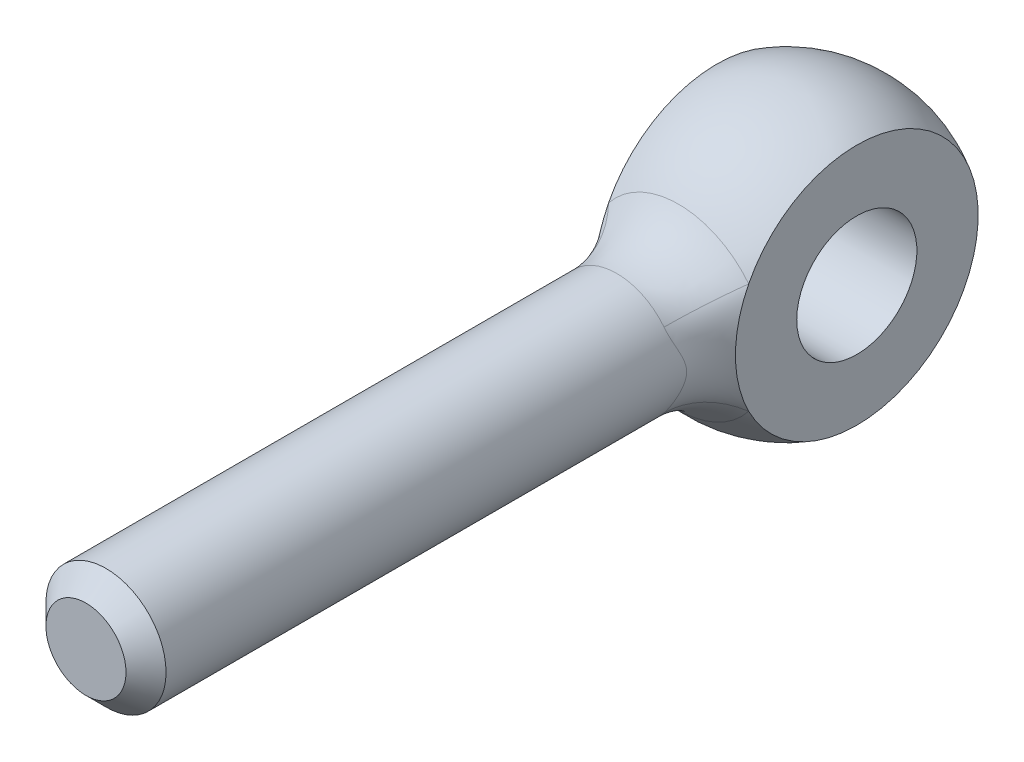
ISO-10303-21;
HEADER;
FILE_DESCRIPTION(('STEP AP214'),'2;1');
FILE_NAME('part.step','',(''),(''),'','','');
FILE_SCHEMA(('AUTOMOTIVE_DESIGN { 1 0 10303 214 1 1 1 1 }'));
ENDSEC;
DATA;
#1=APPLICATION_CONTEXT('core data for automotive mechanical design processes');
#2=APPLICATION_PROTOCOL_DEFINITION('international standard','automotive_design',2000,#1);
#3=PRODUCT_CONTEXT('',#1,'mechanical');
#4=PRODUCT('Part','Part','',(#3));
#5=PRODUCT_RELATED_PRODUCT_CATEGORY('part','',(#4));
#6=PRODUCT_DEFINITION_FORMATION('','',#4);
#7=PRODUCT_DEFINITION_CONTEXT('part definition',#1,'design');
#8=PRODUCT_DEFINITION('design','',#6,#7);
#9=PRODUCT_DEFINITION_SHAPE('','',#8);
#10=(LENGTH_UNIT() NAMED_UNIT(*) SI_UNIT(.MILLI.,.METRE.));
#11=(NAMED_UNIT(*) PLANE_ANGLE_UNIT() SI_UNIT($,.RADIAN.));
#12=(NAMED_UNIT(*) SI_UNIT($,.STERADIAN.) SOLID_ANGLE_UNIT());
#13=UNCERTAINTY_MEASURE_WITH_UNIT(LENGTH_MEASURE(1.E-05),#10,'distance_accuracy_value','');
#14=(GEOMETRIC_REPRESENTATION_CONTEXT(3) GLOBAL_UNCERTAINTY_ASSIGNED_CONTEXT((#13)) GLOBAL_UNIT_ASSIGNED_CONTEXT((#10,
#11,#12)) REPRESENTATION_CONTEXT('',''));
#15=CARTESIAN_POINT('',(0.,0.,0.));
#16=DIRECTION('',(0.,0.,1.));
#17=DIRECTION('',(1.,0.,0.));
#18=AXIS2_PLACEMENT_3D('',#15,#16,#17);
#19=CARTESIAN_POINT('',(0.,0.,0.));
#20=DIRECTION('',(-1.,0.,0.));
#21=DIRECTION('',(0.,0.,-1.));
#22=AXIS2_PLACEMENT_3D('',#19,#20,#21);
#23=SPHERICAL_SURFACE('',#22,7.);
#24=CARTESIAN_POINT('',(3.5,0.,0.));
#25=DIRECTION('',(1.,0.,0.));
#26=DIRECTION('',(0.,0.,1.));
#27=AXIS2_PLACEMENT_3D('',#24,#25,#26);
#28=CIRCLE('',#27,6.06217782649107);
#29=CARTESIAN_POINT('',(3.5,2.75553537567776,5.39972451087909));
#30=VERTEX_POINT('',#29);
#31=CARTESIAN_POINT('',(3.5,-2.75553537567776,5.39972451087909));
#32=VERTEX_POINT('',#31);
#33=EDGE_CURVE('E64',#30,#32,#28,.F.);
#34=ORIENTED_EDGE('',*,*,#33,.T.);
#35=CARTESIAN_POINT('',(0.,0.,5.39972451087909));
#36=DIRECTION('',(0.,0.,-1.));
#37=DIRECTION('',(-1.,0.,0.));
#38=AXIS2_PLACEMENT_3D('',#35,#36,#37);
#39=CIRCLE('',#38,4.45454545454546);
#40=CARTESIAN_POINT('',(-3.5,-2.75553537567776,5.39972451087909));
#41=VERTEX_POINT('',#40);
#42=EDGE_CURVE('E72',#32,#41,#39,.T.);
#43=ORIENTED_EDGE('',*,*,#42,.T.);
#44=CARTESIAN_POINT('',(-3.5,0.,0.));
#45=DIRECTION('',(1.,0.,0.));
#46=DIRECTION('',(0.,0.,1.));
#47=AXIS2_PLACEMENT_3D('',#44,#45,#46);
#48=CIRCLE('',#47,6.06217782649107);
#49=CARTESIAN_POINT('',(-3.5,2.75553537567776,5.39972451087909));
#50=VERTEX_POINT('',#49);
#51=EDGE_CURVE('E60',#50,#41,#48,.F.);
#52=ORIENTED_EDGE('',*,*,#51,.F.);
#53=CARTESIAN_POINT('',(0.,0.,5.39972451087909));
#54=DIRECTION('',(0.,0.,-1.));
#55=DIRECTION('',(-1.,0.,0.));
#56=AXIS2_PLACEMENT_3D('',#53,#54,#55);
#57=CIRCLE('',#56,4.45454545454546);
#58=EDGE_CURVE('E69',#50,#30,#57,.T.);
#59=ORIENTED_EDGE('',*,*,#58,.T.);
#60=EDGE_LOOP('',(#34,#43,#52,#59));
#61=FACE_BOUND('',#60,.T.);
#62=ADVANCED_FACE('F14',(#61),#23,.T.);
#63=CARTESIAN_POINT('',(0.,0.,-10.));
#64=DIRECTION('',(0.,0.,-1.));
#65=DIRECTION('',(1.,0.,0.));
#66=AXIS2_PLACEMENT_3D('',#63,#64,#65);
#67=CYLINDRICAL_SURFACE('',#66,3.);
#68=CARTESIAN_POINT('',(3.5,3.23557827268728,5.12650302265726));
#69=CARTESIAN_POINT('',(2.21863332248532,2.04715505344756,6.30296016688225));
#70=CARTESIAN_POINT('',(1.96436370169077,2.26743803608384,8.38265343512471));
#71=CARTESIAN_POINT('',(3.5,3.1991343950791,5.14950105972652));
#72=CARTESIAN_POINT('',(2.22557997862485,2.03413368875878,6.33043159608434));
#73=CARTESIAN_POINT('',(2.00002659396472,2.23654422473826,8.40046287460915));
#74=CARTESIAN_POINT('',(3.5,3.16190695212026,5.17245733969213));
#75=CARTESIAN_POINT('',(2.23371606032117,2.02068665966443,6.35734290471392));
#76=CARTESIAN_POINT('',(2.03507440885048,2.20470514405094,8.4158033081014));
#77=CARTESIAN_POINT('',(3.5,3.08569578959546,5.21828180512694));
#78=CARTESIAN_POINT('',(2.25234735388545,1.99246404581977,6.40983640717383));
#79=CARTESIAN_POINT('',(2.10377448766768,2.13924810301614,8.44176635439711));
#80=CARTESIAN_POINT('',(3.5,3.04671284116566,5.2411500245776));
#81=CARTESIAN_POINT('',(2.2628303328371,1.97769838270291,6.43541471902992));
#82=CARTESIAN_POINT('',(2.13742735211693,2.10563092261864,8.45239101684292));
#83=CARTESIAN_POINT('',(3.5,2.92713810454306,5.30945187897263));
#84=CARTESIAN_POINT('',(2.29762891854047,1.9308753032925,6.50965537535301));
#85=CARTESIAN_POINT('',(2.23581231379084,2.00253050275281,8.47747005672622));
#86=CARTESIAN_POINT('',(3.5,2.8436146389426,5.35477773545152));
#87=CARTESIAN_POINT('',(2.32540834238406,1.89608630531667,6.55631945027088));
#88=CARTESIAN_POINT('',(2.29827584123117,1.930534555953,8.48527657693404));
#89=CARTESIAN_POINT('',(3.5,2.68828049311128,5.43404462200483));
#90=CARTESIAN_POINT('',(2.38119716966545,1.82520856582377,6.63251730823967));
#91=CARTESIAN_POINT('',(2.40209207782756,1.79867960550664,8.48528503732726));
#92=CARTESIAN_POINT('',(3.5,2.61836938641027,5.46814371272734));
#93=CARTESIAN_POINT('',(2.40751211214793,1.79148689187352,6.66344728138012));
#94=CARTESIAN_POINT('',(2.44494437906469,1.73997552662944,8.48073996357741));
#95=CARTESIAN_POINT('',(3.5,2.47253010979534,5.53561665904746));
#96=CARTESIAN_POINT('',(2.46336082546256,1.71657198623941,6.72077052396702));
#97=CARTESIAN_POINT('',(2.52619122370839,1.61975821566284,8.46374010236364));
#98=CARTESIAN_POINT('',(3.5,2.39660211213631,5.56899053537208));
#99=CARTESIAN_POINT('',(2.49286593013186,1.6754381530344,6.74718644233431));
#100=CARTESIAN_POINT('',(2.56458589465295,1.55824506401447,8.45128554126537));
#101=CARTESIAN_POINT('',(3.5,2.23774111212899,5.63470809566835));
#102=CARTESIAN_POINT('',(2.55372002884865,1.58464459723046,6.7952462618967));
#103=CARTESIAN_POINT('',(2.63684802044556,1.43258848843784,8.41976991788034));
#104=CARTESIAN_POINT('',(3.5,2.15478066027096,5.66704699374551));
#105=CARTESIAN_POINT('',(2.58506432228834,1.5350071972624,6.81690296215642));
#106=CARTESIAN_POINT('',(2.67069626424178,1.36843531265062,8.40068197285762));
#107=CARTESIAN_POINT('',(3.5,1.98146058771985,5.72994859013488));
#108=CARTESIAN_POINT('',(2.64778994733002,1.42682558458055,6.85520056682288));
#109=CARTESIAN_POINT('',(2.73354742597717,1.23812374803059,8.3575760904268));
#110=CARTESIAN_POINT('',(3.5,1.89110305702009,5.76051178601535));
#111=CARTESIAN_POINT('',(2.67917754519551,1.36833105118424,6.87187976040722));
#112=CARTESIAN_POINT('',(2.762551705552,1.17196592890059,8.33355954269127));
#113=CARTESIAN_POINT('',(3.5,1.69949261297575,5.81997315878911));
#114=CARTESIAN_POINT('',(2.74115773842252,1.2403902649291,6.90083647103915));
#115=CARTESIAN_POINT('',(2.81645383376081,1.03590679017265,8.28185197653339));
#116=CARTESIAN_POINT('',(3.5,1.59799422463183,5.84879391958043));
#117=CARTESIAN_POINT('',(2.77173084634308,1.17068445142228,6.91300893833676));
#118=CARTESIAN_POINT('',(2.84120245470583,0.96595270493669,8.25407236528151));
#119=CARTESIAN_POINT('',(3.5,1.38590398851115,5.90264647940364));
#120=CARTESIAN_POINT('',(2.82915481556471,1.02187113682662,6.9327911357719));
#121=CARTESIAN_POINT('',(2.88545377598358,0.824412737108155,8.19818783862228));
#122=CARTESIAN_POINT('',(3.5,1.27531024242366,5.92767748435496));
#123=CARTESIAN_POINT('',(2.85604865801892,0.942756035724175,6.94043354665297));
#124=CARTESIAN_POINT('',(2.90495537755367,0.752826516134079,8.17008285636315));
#125=CARTESIAN_POINT('',(3.5,1.04560560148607,5.97246327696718));
#126=CARTESIAN_POINT('',(2.90411065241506,0.776315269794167,6.95205804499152));
#127=CARTESIAN_POINT('',(2.93855908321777,0.608547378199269,8.11713526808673));
#128=CARTESIAN_POINT('',(3.5,0.926538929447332,5.99224322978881));
#129=CARTESIAN_POINT('',(2.92535761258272,0.688982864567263,6.95608079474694));
#130=CARTESIAN_POINT('',(2.9526870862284,0.535861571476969,8.09227740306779));
#131=CARTESIAN_POINT('',(3.5,0.680543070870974,6.02513117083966));
#132=CARTESIAN_POINT('',(2.96054851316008,0.50740319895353,6.96172989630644));
#133=CARTESIAN_POINT('',(2.97556066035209,0.389275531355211,8.04961466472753));
#134=CARTESIAN_POINT('',(3.5,0.553617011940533,6.03824179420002));
#135=CARTESIAN_POINT('',(2.97454461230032,0.413055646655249,6.96336925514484));
#136=CARTESIAN_POINT('',(2.98430835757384,0.315375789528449,8.03180700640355));
#137=CARTESIAN_POINT('',(3.5,0.303921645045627,6.0557531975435));
#138=CARTESIAN_POINT('',(2.99317980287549,0.227057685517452,6.96533146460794));
#139=CARTESIAN_POINT('',(2.99586345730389,0.172039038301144,8.00773261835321));
#140=CARTESIAN_POINT('',(3.5,0.181493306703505,6.06070443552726));
#141=CARTESIAN_POINT('',(2.99843655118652,0.135573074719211,6.96574247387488));
#142=CARTESIAN_POINT('',(2.9990472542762,0.102656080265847,8.00073868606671));
#143=CARTESIAN_POINT('',(3.5,-0.0639922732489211,6.06308183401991));
#144=CARTESIAN_POINT('',(3.00095906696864,-0.0477841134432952,6.96595496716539));
#145=CARTESIAN_POINT('',(3.00058476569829,-0.0362059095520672,7.99740043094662));
#146=CARTESIAN_POINT('',(3.5,-0.187049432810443,6.06050895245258));
#147=CARTESIAN_POINT('',(2.99822972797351,-0.13979727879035,6.96575683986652));
#148=CARTESIAN_POINT('',(2.99893909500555,-0.105684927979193,8.00105475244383));
#149=CARTESIAN_POINT('',(3.5,-0.430433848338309,6.04811255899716));
#150=CARTESIAN_POINT('',(2.98505607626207,-0.321332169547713,6.96450271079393));
#151=CARTESIAN_POINT('',(2.99083776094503,-0.244419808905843,8.01827198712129));
#152=CARTESIAN_POINT('',(3.5,-0.550747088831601,6.03825791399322));
#153=CARTESIAN_POINT('',(2.97455895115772,-0.410973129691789,6.96344099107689));
#154=CARTESIAN_POINT('',(2.98436144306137,-0.313673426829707,8.03187744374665));
#155=CARTESIAN_POINT('',(3.5,-0.785277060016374,6.0122623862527));
#156=CARTESIAN_POINT('',(2.94680070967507,-0.584817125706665,6.95963907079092));
#157=CARTESIAN_POINT('',(2.96668099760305,-0.451240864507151,8.06646091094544));
#158=CARTESIAN_POINT('',(3.5,-0.899490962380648,5.99611861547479));
#159=CARTESIAN_POINT('',(2.9295000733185,-0.669117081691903,6.95689108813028));
#160=CARTESIAN_POINT('',(2.95547469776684,-0.519554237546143,8.08744230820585));
#161=CARTESIAN_POINT('',(3.5,-1.1446658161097,5.95469893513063));
#162=CARTESIAN_POINT('',(2.88505190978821,-0.848514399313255,6.94781606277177));
#163=CARTESIAN_POINT('',(2.92546212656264,-0.669905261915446,8.13862044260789));
#164=CARTESIAN_POINT('',(3.5,-1.27377773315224,5.92819498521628));
#165=CARTESIAN_POINT('',(2.85652721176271,-0.94190620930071,6.94081419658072));
#166=CARTESIAN_POINT('',(2.90552581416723,-0.751653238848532,8.16982905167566));
#167=CARTESIAN_POINT('',(3.5,-1.52022595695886,5.86983634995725));
#168=CARTESIAN_POINT('',(2.79409663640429,-1.116761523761,6.92132179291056));
#169=CARTESIAN_POINT('',(2.85888787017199,-0.913139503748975,8.23302910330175));
#170=CARTESIAN_POINT('',(3.5,-1.63756103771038,5.83798110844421));
#171=CARTESIAN_POINT('',(2.76012134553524,-1.19824949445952,6.90878561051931));
#172=CARTESIAN_POINT('',(2.83218553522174,-0.992877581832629,8.26502062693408));
#173=CARTESIAN_POINT('',(3.5,-1.8607428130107,5.77071693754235));
#174=CARTESIAN_POINT('',(2.68964762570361,-1.34867453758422,6.8773616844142));
#175=CARTESIAN_POINT('',(2.77218396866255,-1.14979424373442,8.32543949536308));
#176=CARTESIAN_POINT('',(3.5,-1.96662566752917,5.73531991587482));
#177=CARTESIAN_POINT('',(2.65311349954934,-1.41761828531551,6.85843776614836));
#178=CARTESIAN_POINT('',(2.73890649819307,-1.22698031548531,8.35387810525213));
#179=CARTESIAN_POINT('',(3.5,-2.16831663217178,5.66214700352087));
#180=CARTESIAN_POINT('',(2.5801376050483,-1.54353013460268,6.81390806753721));
#181=CARTESIAN_POINT('',(2.66580809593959,-1.37860218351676,8.40405685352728));
#182=CARTESIAN_POINT('',(3.5,-2.26412770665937,5.62437181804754));
#183=CARTESIAN_POINT('',(2.54368572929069,-1.60042771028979,6.7882459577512));
#184=CARTESIAN_POINT('',(2.62598909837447,-1.45303878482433,8.42579896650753));
#185=CARTESIAN_POINT('',(3.5,-2.42732492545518,5.55555313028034));
#186=CARTESIAN_POINT('',(2.48097334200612,-1.69214647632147,6.73662730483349));
#187=CARTESIAN_POINT('',(2.54917488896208,-1.58307726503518,8.45638664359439));
#188=CARTESIAN_POINT('',(3.5,-2.49642063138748,5.52478816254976));
#189=CARTESIAN_POINT('',(2.45416730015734,-1.72909797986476,6.71183508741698));
#190=CARTESIAN_POINT('',(2.51338258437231,-1.63931580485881,8.46699219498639));
#191=CARTESIAN_POINT('',(3.5,-2.62956489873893,5.46267161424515));
#192=CARTESIAN_POINT('',(2.40331863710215,-1.79685748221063,6.658486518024));
#193=CARTESIAN_POINT('',(2.43805487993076,-1.74938114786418,8.48143646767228));
#194=CARTESIAN_POINT('',(3.5,-2.69361495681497,5.43132021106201));
#195=CARTESIAN_POINT('',(2.37929807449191,-1.82762171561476,6.62991439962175));
#196=CARTESIAN_POINT('',(2.39852059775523,-1.80320866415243,8.48527720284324));
#197=CARTESIAN_POINT('',(3.5,-2.81777803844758,5.36796438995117));
#198=CARTESIAN_POINT('',(2.334741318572,-1.88422869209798,6.56907584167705));
#199=CARTESIAN_POINT('',(2.31554978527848,-1.90860230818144,8.48528557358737));
#200=CARTESIAN_POINT('',(3.5,-2.87784826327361,5.33595660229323));
#201=CARTESIAN_POINT('',(2.31427267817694,-1.90997795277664,6.53677079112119));
#202=CARTESIAN_POINT('',(2.27207998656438,-1.96014233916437,8.48138054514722));
#203=CARTESIAN_POINT('',(3.5,-2.99395121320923,5.2716807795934));
#204=CARTESIAN_POINT('',(2.27765115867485,-1.95742199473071,6.46905580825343));
#205=CARTESIAN_POINT('',(2.18187152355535,-2.06009596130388,8.46496397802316));
#206=CARTESIAN_POINT('',(3.5,-3.04997999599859,5.23941252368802));
#207=CARTESIAN_POINT('',(2.26153651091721,-1.97907719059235,6.43364483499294));
#208=CARTESIAN_POINT('',(2.13512975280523,-2.10850649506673,8.45244415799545));
#209=CARTESIAN_POINT('',(3.5,-3.10421473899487,5.20709620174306));
#210=CARTESIAN_POINT('',(2.24791901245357,-1.99926699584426,6.3970130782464));
#211=CARTESIAN_POINT('',(2.08694971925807,-2.15514288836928,8.43522555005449));
#212=(BOUNDED_SURFACE() B_SPLINE_SURFACE(3,2,((#68,#69,#70),(#71,#72,#73),(#74,#75,#76),(#77,
#78,#79),(#80,#81,#82),(#83,#84,#85),(#86,#87,#88),(#89,#90,#91),(#92,#93,#94),(#95,#96,#97),
(#98,#99,#100),(#101,#102,#103),(#104,#105,#106),(#107,#108,#109),(#110,#111,#112),(#113,#114,
#115),(#116,#117,#118),(#119,#120,#121),(#122,#123,#124),(#125,#126,#127),(#128,#129,#130),
(#131,#132,#133),(#134,#135,#136),(#137,#138,#139),(#140,#141,#142),(#143,#144,#145),(#146,#147,
#148),(#149,#150,#151),(#152,#153,#154),(#155,#156,#157),(#158,#159,#160),(#161,#162,#163),
(#164,#165,#166),(#167,#168,#169),(#170,#171,#172),(#173,#174,#175),(#176,#177,#178),(#179,#180,
#181),(#182,#183,#184),(#185,#186,#187),(#188,#189,#190),(#191,#192,#193),(#194,#195,#196),
(#197,#198,#199),(#200,#201,#202),(#203,#204,#205),(#206,#207,#208),(#209,#210,#211)),
.UNSPECIFIED.,.F.,.F.,.F.) B_SPLINE_SURFACE_WITH_KNOTS((4,2,2,2,2,2,2,2,2,2,2,2,2,2,2,2,2,2,2,2,
2,2,2,4),(3,3),(0.,0.334444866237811,0.668744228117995,1.33450545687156,1.84286226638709,
2.35120452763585,2.86163141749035,3.37191458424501,3.8975002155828,4.42319582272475,
4.94632464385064,5.46924660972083,5.95518232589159,6.44105617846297,6.92901948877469,
7.41720714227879,8.01287518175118,8.60860516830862,9.20239558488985,9.79601074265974,
10.2632772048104,10.7304045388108,11.201934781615,11.6739189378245),(0.,1.),
.UNSPECIFIED.) GEOMETRIC_REPRESENTATION_ITEM() RATIONAL_B_SPLINE_SURFACE(((1.,0.884784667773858,
1.),(1.,0.886144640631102,1.),(1.,0.887587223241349,1.),(1.,0.890623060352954,1.),(1.,
0.892216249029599,1.),(1.,0.897187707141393,1.),(1.,0.900769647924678,1.),(1.,0.907408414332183,
1.),(1.,0.91038916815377,1.),(1.,0.916470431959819,1.),(1.,0.919570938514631,1.),(1.,
0.925799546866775,1.),(1.,0.9289277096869,1.),(1.,0.935083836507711,1.),(1.,0.938111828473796,
1.),(1.,0.944034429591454,1.),(1.,0.946922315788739,1.),(1.,0.952322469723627,1.),(1.,
0.954834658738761,1.),(1.,0.959320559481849,1.),(1.,0.961296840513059,1.),(1.,0.964574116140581,
1.),(1.,0.965875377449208,1.),(1.,0.967610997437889,1.),(1.,0.96810016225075,1.),(1.,
0.96833522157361,1.),(1.,0.968081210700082,1.),(1.,0.966853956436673,1.),(1.,0.965877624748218,
1.),(1.,0.963292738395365,1.),(1.,0.961683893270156,1.),(1.,0.957543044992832,1.),(1.,
0.954885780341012,1.),(1.,0.949031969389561,1.),(1.,0.945835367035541,1.),(1.,0.939123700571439,
1.),(1.,0.935609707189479,1.),(1.,0.928447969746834,1.),(1.,0.924800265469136,1.),(1.,
0.918321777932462,1.),(1.,0.915482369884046,1.),(1.,0.909911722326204,1.),(1.,0.907180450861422,
1.),(1.,0.901873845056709,1.),(1.,0.899300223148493,1.),(1.,0.894395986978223,1.),(1.,
0.892065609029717,1.),(1.,0.889888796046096,1.))) REPRESENTATION_ITEM('') SURFACE());
#213=CARTESIAN_POINT('',(2.08694971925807,-2.15514288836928,8.43522555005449));
#214=CARTESIAN_POINT('',(2.13512975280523,-2.10850649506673,8.45244415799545));
#215=CARTESIAN_POINT('',(2.18187152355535,-2.06009596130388,8.46496397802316));
#216=CARTESIAN_POINT('',(2.27207998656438,-1.96014233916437,8.48138054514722));
#217=CARTESIAN_POINT('',(2.31554978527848,-1.90860230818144,8.48528557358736));
#218=CARTESIAN_POINT('',(2.39852059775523,-1.80320866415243,8.48527720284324));
#219=CARTESIAN_POINT('',(2.43805487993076,-1.74938114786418,8.48143646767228));
#220=CARTESIAN_POINT('',(2.51338258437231,-1.63931580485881,8.46699219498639));
#221=CARTESIAN_POINT('',(2.54917488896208,-1.58307726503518,8.45638664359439));
#222=CARTESIAN_POINT('',(2.62598909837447,-1.45303878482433,8.42579896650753));
#223=CARTESIAN_POINT('',(2.66580809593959,-1.37860218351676,8.40405685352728));
#224=CARTESIAN_POINT('',(2.73890649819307,-1.22698031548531,8.35387810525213));
#225=CARTESIAN_POINT('',(2.77218396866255,-1.14979424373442,8.32543949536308));
#226=CARTESIAN_POINT('',(2.83218553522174,-0.992877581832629,8.26502062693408));
#227=CARTESIAN_POINT('',(2.85888787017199,-0.913139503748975,8.23302910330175));
#228=CARTESIAN_POINT('',(2.90552581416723,-0.751653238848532,8.16982905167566));
#229=CARTESIAN_POINT('',(2.92546212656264,-0.669905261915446,8.13862044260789));
#230=CARTESIAN_POINT('',(2.95547469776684,-0.519554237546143,8.08744230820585));
#231=CARTESIAN_POINT('',(2.96668099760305,-0.451240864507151,8.06646091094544));
#232=CARTESIAN_POINT('',(2.98436144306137,-0.313673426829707,8.03187744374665));
#233=CARTESIAN_POINT('',(2.99083776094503,-0.244419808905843,8.01827198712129));
#234=CARTESIAN_POINT('',(2.99893909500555,-0.105684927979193,8.00105475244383));
#235=CARTESIAN_POINT('',(3.00058476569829,-0.0362059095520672,7.99740043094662));
#236=CARTESIAN_POINT('',(2.9990472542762,0.102656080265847,8.00073868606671));
#237=CARTESIAN_POINT('',(2.99586345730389,0.172039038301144,8.00773261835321));
#238=CARTESIAN_POINT('',(2.98430835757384,0.315375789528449,8.03180700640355));
#239=CARTESIAN_POINT('',(2.97556066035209,0.389275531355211,8.04961466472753));
#240=CARTESIAN_POINT('',(2.9526870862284,0.535861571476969,8.09227740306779));
#241=CARTESIAN_POINT('',(2.93855908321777,0.608547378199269,8.11713526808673));
#242=CARTESIAN_POINT('',(2.90495537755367,0.752826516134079,8.17008285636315));
#243=CARTESIAN_POINT('',(2.88545377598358,0.824412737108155,8.19818783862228));
#244=CARTESIAN_POINT('',(2.84120245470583,0.96595270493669,8.25407236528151));
#245=CARTESIAN_POINT('',(2.81645383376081,1.03590679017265,8.28185197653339));
#246=CARTESIAN_POINT('',(2.762551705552,1.17196592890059,8.33355954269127));
#247=CARTESIAN_POINT('',(2.73354742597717,1.23812374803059,8.3575760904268));
#248=CARTESIAN_POINT('',(2.67069626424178,1.36843531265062,8.40068197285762));
#249=CARTESIAN_POINT('',(2.63684802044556,1.43258848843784,8.41976991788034));
#250=CARTESIAN_POINT('',(2.56458589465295,1.55824506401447,8.45128554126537));
#251=CARTESIAN_POINT('',(2.52619122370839,1.61975821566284,8.46374010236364));
#252=CARTESIAN_POINT('',(2.44494437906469,1.73997552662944,8.48073996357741));
#253=CARTESIAN_POINT('',(2.40209207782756,1.79867960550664,8.48528503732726));
#254=CARTESIAN_POINT('',(2.29827584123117,1.930534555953,8.48527657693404));
#255=CARTESIAN_POINT('',(2.23581231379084,2.00253050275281,8.47747005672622));
#256=CARTESIAN_POINT('',(2.13742735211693,2.10563092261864,8.45239101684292));
#257=CARTESIAN_POINT('',(2.10377448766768,2.13924810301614,8.44176635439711));
#258=CARTESIAN_POINT('',(2.03507440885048,2.20470514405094,8.4158033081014));
#259=CARTESIAN_POINT('',(2.00002659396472,2.23654422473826,8.40046287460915));
#260=CARTESIAN_POINT('',(1.96436370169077,2.26743803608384,8.38265343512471));
#261=B_SPLINE_CURVE_WITH_KNOTS('',3,(#213,#214,#215,#216,#217,#218,#219,#220,#221,#222,#223,
#224,#225,#226,#227,#228,#229,#230,#231,#232,#233,#234,#235,#236,#237,#238,#239,#240,#241,#242,
#243,#244,#245,#246,#247,#248,#249,#250,#251,#252,#253,#254,#255,#256,#257,#258,#259,#260),
.UNSPECIFIED.,.F.,.F.,(4,2,2,2,2,2,2,2,2,2,2,2,2,2,2,2,2,2,2,2,2,2,2,4),(0.,0.471984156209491,
0.943514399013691,1.41064173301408,1.87790819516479,2.47152335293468,3.06531376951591,
3.66104375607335,4.25671179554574,4.74489944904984,5.23286275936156,5.71873661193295,
6.20467232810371,6.72759429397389,7.25072311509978,7.77641872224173,8.30200435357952,
8.81228752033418,9.32271441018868,9.83105667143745,10.339413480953,11.0051747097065,
11.3394740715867,11.6739189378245),.UNSPECIFIED.);
#262=CARTESIAN_POINT('',(2.35714285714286,-1.85576872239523,8.48528137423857));
#263=VERTEX_POINT('',#262);
#264=CARTESIAN_POINT('',(2.35714285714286,1.85576872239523,8.48528137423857));
#265=VERTEX_POINT('',#264);
#266=EDGE_CURVE('E87',#263,#265,#261,.T.);
#267=ORIENTED_EDGE('',*,*,#266,.T.);
#268=CARTESIAN_POINT('',(0.,0.,8.48528137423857));
#269=DIRECTION('',(0.,0.,-1.));
#270=DIRECTION('',(-1.,0.,0.));
#271=AXIS2_PLACEMENT_3D('',#268,#269,#270);
#272=CIRCLE('',#271,3.);
#273=CARTESIAN_POINT('',(-2.35714285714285,1.85576872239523,8.48528137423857));
#274=VERTEX_POINT('',#273);
#275=EDGE_CURVE('E9',#265,#274,#272,.F.);
#276=ORIENTED_EDGE('',*,*,#275,.T.);
#277=CARTESIAN_POINT('',(-3.5,-3.23557831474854,5.12650299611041));
#278=CARTESIAN_POINT('',(-2.21863331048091,-2.04715506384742,6.30296013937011));
#279=CARTESIAN_POINT('',(-1.96436370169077,-2.26743803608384,8.38265343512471));
#280=CARTESIAN_POINT('',(-3.5,-3.19913441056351,5.14950104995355));
#281=CARTESIAN_POINT('',(-2.22557997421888,-2.03413369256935,6.330431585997));
#282=CARTESIAN_POINT('',(-2.00002659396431,-2.23654422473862,8.40046287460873));
#283=CARTESIAN_POINT('',(-3.5,-3.16190695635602,5.17245733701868));
#284=CARTESIAN_POINT('',(-2.23371605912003,-2.0206866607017,6.35734290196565));
#285=CARTESIAN_POINT('',(-2.03507440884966,-2.20470514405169,8.41580330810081));
#286=CARTESIAN_POINT('',(-3.5,-3.08569578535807,5.21828180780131));
#287=CARTESIAN_POINT('',(-2.25234735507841,-1.9924640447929,6.40983640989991));
#288=CARTESIAN_POINT('',(-2.10377448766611,-2.13924810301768,8.4417663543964));
#289=CARTESIAN_POINT('',(-3.5,-3.04671283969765,5.24115002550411));
#290=CARTESIAN_POINT('',(-2.26283033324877,-1.9776983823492,6.43541471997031));
#291=CARTESIAN_POINT('',(-2.13742735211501,-2.10563092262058,8.45239101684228));
#292=CARTESIAN_POINT('',(-3.5,-2.92713810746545,5.30945187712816));
#293=CARTESIAN_POINT('',(-2.29762891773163,-1.93087530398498,6.50965537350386));
#294=CARTESIAN_POINT('',(-2.2358123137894,-2.00253050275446,8.47747005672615));
#295=CARTESIAN_POINT('',(-3.5,-2.8436146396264,5.35477773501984));
#296=CARTESIAN_POINT('',(-2.32540834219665,-1.89608630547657,6.55631944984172));
#297=CARTESIAN_POINT('',(-2.29827584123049,-1.93053455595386,8.48527657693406));
#298=CARTESIAN_POINT('',(-3.5,-2.68828049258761,5.43404462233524));
#299=CARTESIAN_POINT('',(-2.3811971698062,-1.82520856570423,6.63251730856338));
#300=CARTESIAN_POINT('',(-2.40209207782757,-1.79867960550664,8.48528503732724));
#301=CARTESIAN_POINT('',(-3.5,-2.61836938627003,5.46814371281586));
#302=CARTESIAN_POINT('',(-2.40751211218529,-1.79148689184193,6.6634472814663));
#303=CARTESIAN_POINT('',(-2.44494437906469,-1.73997552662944,8.48073996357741));
#304=CARTESIAN_POINT('',(-3.5,-2.47253010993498,5.53561665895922));
#305=CARTESIAN_POINT('',(-2.46336082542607,-1.71657198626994,6.72077052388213));
#306=CARTESIAN_POINT('',(-2.52619122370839,-1.61975821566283,8.46374010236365));
#307=CARTESIAN_POINT('',(-3.5,-2.39660211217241,5.56899053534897));
#308=CARTESIAN_POINT('',(-2.49286593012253,-1.67543815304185,6.74718644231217));
#309=CARTESIAN_POINT('',(-2.56458589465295,-1.55824506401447,8.45128554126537));
#310=CARTESIAN_POINT('',(-3.5,-2.23774111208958,5.63470809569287));
#311=CARTESIAN_POINT('',(-2.55372002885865,-1.58464459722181,6.79524626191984));
#312=CARTESIAN_POINT('',(-2.63684802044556,-1.43258848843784,8.41976991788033));
#313=CARTESIAN_POINT('',(-3.5,-2.15478066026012,5.6670469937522));
#314=CARTESIAN_POINT('',(-2.58506432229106,-1.53500719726,6.81690296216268));
#315=CARTESIAN_POINT('',(-2.67069626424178,-1.36843531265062,8.40068197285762));
#316=CARTESIAN_POINT('',(-3.5,-1.98146058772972,5.72994859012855));
#317=CARTESIAN_POINT('',(-2.64778994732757,-1.42682558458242,6.85520056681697));
#318=CARTESIAN_POINT('',(-2.73354742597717,-1.23812374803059,8.3575760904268));
#319=CARTESIAN_POINT('',(-3.5,-1.8911030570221,5.76051178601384));
#320=CARTESIAN_POINT('',(-2.67917754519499,-1.3683310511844,6.8718797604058));
#321=CARTESIAN_POINT('',(-2.762551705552,-1.17196592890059,8.33355954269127));
#322=CARTESIAN_POINT('',(-3.5,-1.69949261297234,5.81997315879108));
#323=CARTESIAN_POINT('',(-2.74115773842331,-1.24039026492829,6.90083647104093));
#324=CARTESIAN_POINT('',(-2.81645383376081,-1.03590679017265,8.28185197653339));
#325=CARTESIAN_POINT('',(-3.5,-1.5979942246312,5.84879391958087));
#326=CARTESIAN_POINT('',(-2.77173084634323,-1.17068445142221,6.91300893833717));
#327=CARTESIAN_POINT('',(-2.84120245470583,-0.965952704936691,8.25407236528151));
#328=CARTESIAN_POINT('',(-3.5,-1.38590398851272,5.90264647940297));
#329=CARTESIAN_POINT('',(-2.82915481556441,-1.02187113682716,6.93279113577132));
#330=CARTESIAN_POINT('',(-2.88545377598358,-0.824412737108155,8.19818783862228));
#331=CARTESIAN_POINT('',(-3.5,-1.27531024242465,5.92767748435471));
#332=CARTESIAN_POINT('',(-2.85604865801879,-0.942756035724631,6.94043354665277));
#333=CARTESIAN_POINT('',(-2.90495537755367,-0.75282651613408,8.17008285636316));
#334=CARTESIAN_POINT('',(-3.5,-1.04560560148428,5.97246327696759));
#335=CARTESIAN_POINT('',(-2.90411065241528,-0.776315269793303,6.95205804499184));
#336=CARTESIAN_POINT('',(-2.93855908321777,-0.60854737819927,8.11713526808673));
#337=CARTESIAN_POINT('',(-3.5,-0.926538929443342,5.99224322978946));
#338=CARTESIAN_POINT('',(-2.92535761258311,-0.688982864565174,6.95608079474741));
#339=CARTESIAN_POINT('',(-2.9526870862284,-0.53586157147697,8.09227740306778));
#340=CARTESIAN_POINT('',(-3.5,-0.6805430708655,6.02513117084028));
#341=CARTESIAN_POINT('',(-2.96054851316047,-0.507403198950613,6.96172989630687));
#342=CARTESIAN_POINT('',(-2.97556066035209,-0.389275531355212,8.04961466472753));
#343=CARTESIAN_POINT('',(-3.5,-0.553617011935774,6.03824179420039));
#344=CARTESIAN_POINT('',(-2.97454461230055,-0.413055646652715,6.9633692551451));
#345=CARTESIAN_POINT('',(-2.98430835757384,-0.315375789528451,8.03180700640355));
#346=CARTESIAN_POINT('',(-3.5,-0.303921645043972,6.05575319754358));
#347=CARTESIAN_POINT('',(-2.99317980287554,-0.22705768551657,6.965331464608));
#348=CARTESIAN_POINT('',(-2.99586345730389,-0.172039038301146,8.00773261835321));
#349=CARTESIAN_POINT('',(-3.5,-0.181493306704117,6.0607044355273));
#350=CARTESIAN_POINT('',(-2.99843655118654,-0.135573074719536,6.9657424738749));
#351=CARTESIAN_POINT('',(-2.9990472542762,-0.102656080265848,8.00073868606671));
#352=CARTESIAN_POINT('',(-3.5,0.0639922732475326,6.06308183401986));
#353=CARTESIAN_POINT('',(-3.00095906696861,0.0477841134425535,6.96595496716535));
#354=CARTESIAN_POINT('',(-3.00058476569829,0.0362059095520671,7.99740043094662));
#355=CARTESIAN_POINT('',(-3.5,0.187049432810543,6.06050895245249));
#356=CARTESIAN_POINT('',(-2.99822972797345,0.139797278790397,6.96575683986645));
#357=CARTESIAN_POINT('',(-2.99893909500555,0.105684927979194,8.00105475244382));
#358=CARTESIAN_POINT('',(-3.5,0.430433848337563,6.04811255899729));
#359=CARTESIAN_POINT('',(-2.98505607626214,0.321332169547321,6.96450271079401));
#360=CARTESIAN_POINT('',(-2.99083776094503,0.244419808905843,8.01827198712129));
#361=CARTESIAN_POINT('',(-3.5,0.550747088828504,6.03825791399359));
#362=CARTESIAN_POINT('',(-2.97455895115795,0.410973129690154,6.96344099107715));
#363=CARTESIAN_POINT('',(-2.98436144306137,0.313673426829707,8.03187744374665));
#364=CARTESIAN_POINT('',(-3.5,0.78527706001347,6.012262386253));
#365=CARTESIAN_POINT('',(-2.94680070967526,0.584817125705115,6.95963907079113));
#366=CARTESIAN_POINT('',(-2.96668099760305,0.451240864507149,8.06646091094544));
#367=CARTESIAN_POINT('',(-3.5,0.899490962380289,5.99611861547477));
#368=CARTESIAN_POINT('',(-2.92950007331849,0.669117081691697,6.95689108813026));
#369=CARTESIAN_POINT('',(-2.95547469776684,0.51955423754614,8.08744230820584));
#370=CARTESIAN_POINT('',(-3.5,1.14466581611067,5.95469893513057));
#371=CARTESIAN_POINT('',(-2.88505190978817,0.848514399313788,6.94781606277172));
#372=CARTESIAN_POINT('',(-2.92546212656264,0.669905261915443,8.13862044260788));
#373=CARTESIAN_POINT('',(-3.5,1.27377773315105,5.92819498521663));
#374=CARTESIAN_POINT('',(-2.85652721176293,0.941906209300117,6.94081419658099));
#375=CARTESIAN_POINT('',(-2.90552581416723,0.751653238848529,8.16982905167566));
#376=CARTESIAN_POINT('',(-3.5,1.52022595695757,5.86983634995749));
#377=CARTESIAN_POINT('',(-2.79409663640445,1.11676152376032,6.92132179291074));
#378=CARTESIAN_POINT('',(-2.85888787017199,0.913139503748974,8.23302910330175));
#379=CARTESIAN_POINT('',(-3.5,1.63756103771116,5.83798110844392));
#380=CARTESIAN_POINT('',(-2.76012134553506,1.19824949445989,6.90878561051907));
#381=CARTESIAN_POINT('',(-2.83218553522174,0.992877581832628,8.26502062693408));
#382=CARTESIAN_POINT('',(-3.5,1.86074281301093,5.77071693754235));
#383=CARTESIAN_POINT('',(-2.6896476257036,1.34867453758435,6.8773616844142));
#384=CARTESIAN_POINT('',(-2.77218396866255,1.14979424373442,8.32543949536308));
#385=CARTESIAN_POINT('',(-3.5,1.9666256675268,5.73531991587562));
#386=CARTESIAN_POINT('',(-2.65311349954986,1.41761828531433,6.85843776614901));
#387=CARTESIAN_POINT('',(-2.73890649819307,1.22698031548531,8.35387810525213));
#388=CARTESIAN_POINT('',(-3.5,2.16831663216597,5.66214700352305));
#389=CARTESIAN_POINT('',(-2.58013760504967,1.54353013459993,6.81390806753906));
#390=CARTESIAN_POINT('',(-2.66580809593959,1.37860218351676,8.40405685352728));
#391=CARTESIAN_POINT('',(-3.5,2.26412770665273,5.62437181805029));
#392=CARTESIAN_POINT('',(-2.5436857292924,1.60042771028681,6.78824595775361));
#393=CARTESIAN_POINT('',(-2.62598909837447,1.45303878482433,8.42579896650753));
#394=CARTESIAN_POINT('',(-3.5,2.42732492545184,5.55555313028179));
#395=CARTESIAN_POINT('',(-2.48097334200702,1.69214647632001,6.7366273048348));
#396=CARTESIAN_POINT('',(-2.54917488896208,1.58307726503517,8.45638664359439));
#397=CARTESIAN_POINT('',(-3.5,2.49642063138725,5.52478816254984));
#398=CARTESIAN_POINT('',(-2.45416730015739,1.72909797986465,6.71183508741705));
#399=CARTESIAN_POINT('',(-2.51338258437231,1.63931580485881,8.46699219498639));
#400=CARTESIAN_POINT('',(-3.5,2.62956489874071,5.46267161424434));
#401=CARTESIAN_POINT('',(-2.40331863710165,1.79685748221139,6.65848651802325));
#402=CARTESIAN_POINT('',(-2.43805487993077,1.74938114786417,8.48143646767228));
#403=CARTESIAN_POINT('',(-3.5,2.69361495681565,5.43132021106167));
#404=CARTESIAN_POINT('',(-2.37929807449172,1.82762171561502,6.62991439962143));
#405=CARTESIAN_POINT('',(-2.39852059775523,1.80320866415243,8.48527720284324));
#406=CARTESIAN_POINT('',(-3.5,2.8177780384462,5.36796438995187));
#407=CARTESIAN_POINT('',(-2.33474131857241,1.88422869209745,6.56907584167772));
#408=CARTESIAN_POINT('',(-2.31554978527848,1.90860230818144,8.48528557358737));
#409=CARTESIAN_POINT('',(-3.5,2.87784826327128,5.3359566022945));
#410=CARTESIAN_POINT('',(-2.31427267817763,1.90997795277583,6.53677079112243));
#411=CARTESIAN_POINT('',(-2.27207998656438,1.96014233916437,8.48138054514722));
#412=CARTESIAN_POINT('',(-3.5,2.99395121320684,5.27168077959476));
#413=CARTESIAN_POINT('',(-2.27765115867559,1.95742199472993,6.46905580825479));
#414=CARTESIAN_POINT('',(-2.18187152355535,2.06009596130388,8.46496397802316));
#415=CARTESIAN_POINT('',(-3.5,3.0499799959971,5.23941252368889));
#416=CARTESIAN_POINT('',(-2.26153651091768,1.9790771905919,6.43364483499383));
#417=CARTESIAN_POINT('',(-2.13512975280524,2.10850649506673,8.45244415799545));
#418=CARTESIAN_POINT('',(-3.5,3.10421473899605,5.20709620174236));
#419=CARTESIAN_POINT('',(-2.24791901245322,1.9992669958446,6.39701307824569));
#420=CARTESIAN_POINT('',(-2.08694971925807,2.15514288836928,8.43522555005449));
#421=(BOUNDED_SURFACE() B_SPLINE_SURFACE(3,2,((#277,#278,#279),(#280,#281,#282),(#283,#284,
#285),(#286,#287,#288),(#289,#290,#291),(#292,#293,#294),(#295,#296,#297),(#298,#299,#300),
(#301,#302,#303),(#304,#305,#306),(#307,#308,#309),(#310,#311,#312),(#313,#314,#315),(#316,#317,
#318),(#319,#320,#321),(#322,#323,#324),(#325,#326,#327),(#328,#329,#330),(#331,#332,#333),
(#334,#335,#336),(#337,#338,#339),(#340,#341,#342),(#343,#344,#345),(#346,#347,#348),(#349,#350,
#351),(#352,#353,#354),(#355,#356,#357),(#358,#359,#360),(#361,#362,#363),(#364,#365,#366),
(#367,#368,#369),(#370,#371,#372),(#373,#374,#375),(#376,#377,#378),(#379,#380,#381),(#382,#383,
#384),(#385,#386,#387),(#388,#389,#390),(#391,#392,#393),(#394,#395,#396),(#397,#398,#399),
(#400,#401,#402),(#403,#404,#405),(#406,#407,#408),(#409,#410,#411),(#412,#413,#414),(#415,#416,
#417),(#418,#419,#420)),.UNSPECIFIED.,.F.,.F.,.F.) B_SPLINE_SURFACE_WITH_KNOTS((4,2,2,2,2,2,2,2,
2,2,2,2,2,2,2,2,2,2,2,2,2,2,2,4),(3,3),(0.,0.33444486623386,0.668744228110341,1.33450545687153,
1.84286226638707,2.35120452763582,2.86163141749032,3.37191458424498,3.89750021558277,
4.42319582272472,4.94632464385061,5.4692466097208,5.95518232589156,6.44105617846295,
6.92901948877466,7.41720714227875,8.01287518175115,8.60860516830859,9.20239558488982,
9.79601074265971,10.2632772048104,10.7304045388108,11.201934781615,11.6739189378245),(0.,1.),
.UNSPECIFIED.) GEOMETRIC_REPRESENTATION_ITEM() RATIONAL_B_SPLINE_SURFACE(((1.,0.884784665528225,
1.),(1.,0.886144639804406,1.),(1.,0.887587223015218,1.),(1.,0.890623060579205,1.),(1.,
0.892216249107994,1.),(1.,0.897187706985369,1.),(1.,0.900769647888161,1.),(1.,0.907408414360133,
1.),(1.,0.910389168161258,1.),(1.,0.916470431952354,1.),(1.,0.919570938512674,1.),(1.,
0.925799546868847,1.),(1.,0.928927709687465,1.),(1.,0.935083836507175,1.),(1.,0.938111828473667,
1.),(1.,0.94403442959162,1.),(1.,0.946922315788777,1.),(1.,0.952322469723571,1.),(1.,
0.954834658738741,1.),(1.,0.959320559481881,1.),(1.,0.961296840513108,1.),(1.,0.964574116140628,
1.),(1.,0.965875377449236,1.),(1.,0.967610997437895,1.),(1.,0.968100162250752,1.),(1.,
0.968335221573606,1.),(1.,0.968081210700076,1.),(1.,0.966853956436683,1.),(1.,0.965877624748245,
1.),(1.,0.963292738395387,1.),(1.,0.961683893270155,1.),(1.,0.957543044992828,1.),(1.,
0.95488578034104,1.),(1.,0.949031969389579,1.),(1.,0.945835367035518,1.),(1.,0.939123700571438,
1.),(1.,0.935609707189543,1.),(1.,0.928447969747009,1.),(1.,0.92480026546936,1.),(1.,
0.918321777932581,1.),(1.,0.915482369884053,1.),(1.,0.909911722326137,1.),(1.,0.907180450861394,
1.),(1.,0.901873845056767,1.),(1.,0.8993002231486,1.),(1.,0.894395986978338,1.),(1.,
0.892065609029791,1.),(1.,0.889888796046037,1.))) REPRESENTATION_ITEM('') SURFACE());
#422=CARTESIAN_POINT('',(-2.08694971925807,2.15514288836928,8.43522555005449));
#423=CARTESIAN_POINT('',(-2.13512975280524,2.10850649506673,8.45244415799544));
#424=CARTESIAN_POINT('',(-2.18187152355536,2.06009596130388,8.46496397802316));
#425=CARTESIAN_POINT('',(-2.27207998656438,1.96014233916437,8.48138054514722));
#426=CARTESIAN_POINT('',(-2.31554978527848,1.90860230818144,8.48528557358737));
#427=CARTESIAN_POINT('',(-2.39852059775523,1.80320866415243,8.48527720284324));
#428=CARTESIAN_POINT('',(-2.43805487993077,1.74938114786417,8.48143646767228));
#429=CARTESIAN_POINT('',(-2.51338258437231,1.63931580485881,8.46699219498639));
#430=CARTESIAN_POINT('',(-2.54917488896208,1.58307726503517,8.45638664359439));
#431=CARTESIAN_POINT('',(-2.62598909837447,1.45303878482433,8.42579896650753));
#432=CARTESIAN_POINT('',(-2.66580809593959,1.37860218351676,8.40405685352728));
#433=CARTESIAN_POINT('',(-2.73890649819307,1.22698031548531,8.35387810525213));
#434=CARTESIAN_POINT('',(-2.77218396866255,1.14979424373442,8.32543949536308));
#435=CARTESIAN_POINT('',(-2.83218553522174,0.992877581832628,8.26502062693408));
#436=CARTESIAN_POINT('',(-2.85888787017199,0.913139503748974,8.23302910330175));
#437=CARTESIAN_POINT('',(-2.90552581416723,0.751653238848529,8.16982905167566));
#438=CARTESIAN_POINT('',(-2.92546212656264,0.669905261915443,8.13862044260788));
#439=CARTESIAN_POINT('',(-2.95547469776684,0.51955423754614,8.08744230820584));
#440=CARTESIAN_POINT('',(-2.96668099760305,0.451240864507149,8.06646091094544));
#441=CARTESIAN_POINT('',(-2.98436144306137,0.313673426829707,8.03187744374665));
#442=CARTESIAN_POINT('',(-2.99083776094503,0.244419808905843,8.01827198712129));
#443=CARTESIAN_POINT('',(-2.99893909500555,0.105684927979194,8.00105475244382));
#444=CARTESIAN_POINT('',(-3.00058476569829,0.036205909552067,7.99740043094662));
#445=CARTESIAN_POINT('',(-2.9990472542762,-0.102656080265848,8.00073868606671));
#446=CARTESIAN_POINT('',(-2.99586345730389,-0.172039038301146,8.00773261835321));
#447=CARTESIAN_POINT('',(-2.98430835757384,-0.315375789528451,8.03180700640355));
#448=CARTESIAN_POINT('',(-2.97556066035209,-0.389275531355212,8.04961466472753));
#449=CARTESIAN_POINT('',(-2.9526870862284,-0.53586157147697,8.09227740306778));
#450=CARTESIAN_POINT('',(-2.93855908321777,-0.60854737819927,8.11713526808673));
#451=CARTESIAN_POINT('',(-2.90495537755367,-0.75282651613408,8.17008285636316));
#452=CARTESIAN_POINT('',(-2.88545377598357,-0.824412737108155,8.19818783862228));
#453=CARTESIAN_POINT('',(-2.84120245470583,-0.965952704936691,8.25407236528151));
#454=CARTESIAN_POINT('',(-2.81645383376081,-1.03590679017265,8.28185197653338));
#455=CARTESIAN_POINT('',(-2.762551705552,-1.17196592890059,8.33355954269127));
#456=CARTESIAN_POINT('',(-2.73354742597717,-1.23812374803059,8.3575760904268));
#457=CARTESIAN_POINT('',(-2.67069626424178,-1.36843531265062,8.40068197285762));
#458=CARTESIAN_POINT('',(-2.63684802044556,-1.43258848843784,8.41976991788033));
#459=CARTESIAN_POINT('',(-2.56458589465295,-1.55824506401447,8.45128554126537));
#460=CARTESIAN_POINT('',(-2.52619122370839,-1.61975821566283,8.46374010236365));
#461=CARTESIAN_POINT('',(-2.44494437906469,-1.73997552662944,8.4807399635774));
#462=CARTESIAN_POINT('',(-2.40209207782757,-1.79867960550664,8.48528503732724));
#463=CARTESIAN_POINT('',(-2.29827584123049,-1.93053455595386,8.48527657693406));
#464=CARTESIAN_POINT('',(-2.2358123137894,-2.00253050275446,8.47747005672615));
#465=CARTESIAN_POINT('',(-2.13742735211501,-2.10563092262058,8.45239101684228));
#466=CARTESIAN_POINT('',(-2.10377448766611,-2.13924810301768,8.4417663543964));
#467=CARTESIAN_POINT('',(-2.03507440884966,-2.20470514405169,8.41580330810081));
#468=CARTESIAN_POINT('',(-2.00002659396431,-2.23654422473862,8.40046287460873));
#469=CARTESIAN_POINT('',(-1.96436370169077,-2.26743803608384,8.38265343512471));
#470=B_SPLINE_CURVE_WITH_KNOTS('',3,(#422,#423,#424,#425,#426,#427,#428,#429,#430,#431,#432,
#433,#434,#435,#436,#437,#438,#439,#440,#441,#442,#443,#444,#445,#446,#447,#448,#449,#450,#451,
#452,#453,#454,#455,#456,#457,#458,#459,#460,#461,#462,#463,#464,#465,#466,#467,#468,#469),
.UNSPECIFIED.,.F.,.F.,(4,2,2,2,2,2,2,2,2,2,2,2,2,2,2,2,2,2,2,2,2,2,2,4),(0.,0.47198415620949,
0.94351439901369,1.41064173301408,1.87790819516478,2.47152335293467,3.0653137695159,
3.66104375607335,4.25671179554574,4.74489944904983,5.23286275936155,5.71873661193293,
6.20467232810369,6.72759429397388,7.25072311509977,7.77641872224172,8.30200435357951,
8.81228752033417,9.32271441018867,9.83105667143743,10.339413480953,11.0051747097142,
11.3394740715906,11.6739189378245),.UNSPECIFIED.);
#471=CARTESIAN_POINT('',(-2.35714285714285,-1.85576872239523,8.48528137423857));
#472=VERTEX_POINT('',#471);
#473=EDGE_CURVE('E27',#274,#472,#470,.T.);
#474=ORIENTED_EDGE('',*,*,#473,.T.);
#475=CARTESIAN_POINT('',(0.,0.,8.48528137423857));
#476=DIRECTION('',(0.,0.,-1.));
#477=DIRECTION('',(-1.,0.,0.));
#478=AXIS2_PLACEMENT_3D('',#475,#476,#477);
#479=CIRCLE('',#478,3.);
#480=EDGE_CURVE('E101',#472,#263,#479,.F.);
#481=ORIENTED_EDGE('',*,*,#480,.T.);
#482=EDGE_LOOP('',(#267,#276,#474,#481));
#483=FACE_BOUND('',#482,.T.);
#484=CARTESIAN_POINT('',(0.,0.,34.));
#485=DIRECTION('',(0.,0.,-1.));
#486=DIRECTION('',(1.,0.,0.));
#487=AXIS2_PLACEMENT_3D('',#484,#485,#486);
#488=CIRCLE('',#487,3.);
#489=CARTESIAN_POINT('',(3.,0.,34.));
#490=VERTEX_POINT('',#489);
#491=EDGE_CURVE('E85',#490,#490,#488,.T.);
#492=ORIENTED_EDGE('',*,*,#491,.T.);
#493=EDGE_LOOP('',(#492));
#494=FACE_BOUND('',#493,.T.);
#495=ADVANCED_FACE('F107',(#483,#494),#67,.T.);
#496=CARTESIAN_POINT('',(0.,0.,35.));
#497=DIRECTION('',(0.,0.,-1.));
#498=DIRECTION('',(1.,0.,0.));
#499=AXIS2_PLACEMENT_3D('',#496,#497,#498);
#500=CONICAL_SURFACE('',#499,2.,0.785398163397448);
#501=ORIENTED_EDGE('',*,*,#491,.F.);
#502=EDGE_LOOP('',(#501));
#503=FACE_BOUND('',#502,.T.);
#504=CARTESIAN_POINT('',(0.,0.,35.));
#505=DIRECTION('',(0.,0.,-1.));
#506=DIRECTION('',(1.,0.,0.));
#507=AXIS2_PLACEMENT_3D('',#504,#505,#506);
#508=CIRCLE('',#507,2.);
#509=CARTESIAN_POINT('',(2.,0.,35.));
#510=VERTEX_POINT('',#509);
#511=EDGE_CURVE('E73',#510,#510,#508,.T.);
#512=ORIENTED_EDGE('',*,*,#511,.T.);
#513=EDGE_LOOP('',(#512));
#514=FACE_BOUND('',#513,.T.);
#515=ADVANCED_FACE('F111',(#503,#514),#500,.T.);
#516=CARTESIAN_POINT('',(0.,-2.,35.));
#517=DIRECTION('',(0.,0.,1.));
#518=DIRECTION('',(-1.,0.,0.));
#519=AXIS2_PLACEMENT_3D('',#516,#517,#518);
#520=PLANE('',#519);
#521=ORIENTED_EDGE('',*,*,#511,.F.);
#522=EDGE_LOOP('',(#521));
#523=FACE_BOUND('',#522,.T.);
#524=ADVANCED_FACE('F158',(#523),#520,.T.);
#525=CARTESIAN_POINT('',(-3.5,10.,-10.));
#526=DIRECTION('',(1.,0.,0.));
#527=DIRECTION('',(0.,0.,1.));
#528=AXIS2_PLACEMENT_3D('',#525,#526,#527);
#529=PLANE('',#528);
#530=CARTESIAN_POINT('',(-3.5,0.,0.));
#531=DIRECTION('',(1.,0.,0.));
#532=DIRECTION('',(0.,0.,1.));
#533=AXIS2_PLACEMENT_3D('',#530,#531,#532);
#534=CIRCLE('',#533,3.);
#535=CARTESIAN_POINT('',(-3.5,0.,3.));
#536=VERTEX_POINT('',#535);
#537=EDGE_CURVE('E253',#536,#536,#534,.T.);
#538=ORIENTED_EDGE('',*,*,#537,.T.);
#539=EDGE_LOOP('',(#538));
#540=FACE_BOUND('',#539,.T.);
#541=ORIENTED_EDGE('',*,*,#51,.T.);
#542=EDGE_CURVE('E57',#41,#50,#48,.F.);
#543=ORIENTED_EDGE('',*,*,#542,.T.);
#544=EDGE_LOOP('',(#541,#543));
#545=FACE_BOUND('',#544,.T.);
#546=ADVANCED_FACE('F59',(#540,#545),#529,.F.);
#547=CARTESIAN_POINT('',(3.5,10.,-10.));
#548=DIRECTION('',(1.,0.,0.));
#549=DIRECTION('',(0.,0.,1.));
#550=AXIS2_PLACEMENT_3D('',#547,#548,#549);
#551=PLANE('',#550);
#552=CARTESIAN_POINT('',(3.5,0.,0.));
#553=DIRECTION('',(1.,0.,0.));
#554=DIRECTION('',(0.,0.,1.));
#555=AXIS2_PLACEMENT_3D('',#552,#553,#554);
#556=CIRCLE('',#555,3.);
#557=CARTESIAN_POINT('',(3.5,0.,3.));
#558=VERTEX_POINT('',#557);
#559=EDGE_CURVE('E78',#558,#558,#556,.T.);
#560=ORIENTED_EDGE('',*,*,#559,.F.);
#561=EDGE_LOOP('',(#560));
#562=FACE_BOUND('',#561,.T.);
#563=ORIENTED_EDGE('',*,*,#33,.F.);
#564=EDGE_CURVE('E249',#32,#30,#28,.F.);
#565=ORIENTED_EDGE('',*,*,#564,.F.);
#566=EDGE_LOOP('',(#563,#565));
#567=FACE_BOUND('',#566,.T.);
#568=ADVANCED_FACE('F151',(#562,#567),#551,.T.);
#569=CARTESIAN_POINT('',(10.,0.,0.));
#570=DIRECTION('',(-1.,0.,0.));
#571=DIRECTION('',(0.,0.,-1.));
#572=AXIS2_PLACEMENT_3D('',#569,#570,#571);
#573=CYLINDRICAL_SURFACE('',#572,3.);
#574=ORIENTED_EDGE('',*,*,#559,.T.);
#575=EDGE_LOOP('',(#574));
#576=FACE_BOUND('',#575,.T.);
#577=ORIENTED_EDGE('',*,*,#537,.F.);
#578=EDGE_LOOP('',(#577));
#579=FACE_BOUND('',#578,.T.);
#580=ADVANCED_FACE('F126',(#576,#579),#573,.F.);
#581=CARTESIAN_POINT('',(-5.5,-4.3301270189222,8.48528137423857));
#582=DIRECTION('',(0.618589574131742,-0.785714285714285,0.));
#583=DIRECTION('',(0.785714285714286,0.618589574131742,0.));
#584=AXIS2_PLACEMENT_3D('',#581,#582,#583);
#585=CIRCLE('',#584,4.);
#586=EDGE_CURVE('E79',#472,#41,#585,.F.);
#587=ORIENTED_EDGE('',*,*,#586,.F.);
#588=ORIENTED_EDGE('',*,*,#473,.F.);
#589=CARTESIAN_POINT('',(-5.5,4.3301270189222,8.48528137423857));
#590=DIRECTION('',(-0.618589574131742,-0.785714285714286,0.));
#591=DIRECTION('',(0.785714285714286,-0.618589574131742,0.));
#592=AXIS2_PLACEMENT_3D('',#589,#590,#591);
#593=CIRCLE('',#592,4.);
#594=EDGE_CURVE('E75',#50,#274,#593,.T.);
#595=ORIENTED_EDGE('',*,*,#594,.F.);
#596=ORIENTED_EDGE('',*,*,#542,.F.);
#597=EDGE_LOOP('',(#587,#588,#595,#596));
#598=FACE_BOUND('',#597,.T.);
#599=ADVANCED_FACE('F76',(#598),#421,.F.);
#600=CARTESIAN_POINT('',(0.,0.,8.48528137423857));
#601=DIRECTION('',(0.,0.,-1.));
#602=DIRECTION('',(-1.,0.,0.));
#603=AXIS2_PLACEMENT_3D('',#600,#601,#602);
#604=TOROIDAL_SURFACE('',#603,7.,4.);
#605=ORIENTED_EDGE('',*,*,#594,.T.);
#606=ORIENTED_EDGE('',*,*,#275,.F.);
#607=CARTESIAN_POINT('',(5.5,4.3301270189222,8.48528137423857));
#608=DIRECTION('',(-0.618589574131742,0.785714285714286,0.));
#609=DIRECTION('',(-0.785714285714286,-0.618589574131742,0.));
#610=AXIS2_PLACEMENT_3D('',#607,#608,#609);
#611=CIRCLE('',#610,4.);
#612=EDGE_CURVE('E83',#30,#265,#611,.T.);
#613=ORIENTED_EDGE('',*,*,#612,.F.);
#614=ORIENTED_EDGE('',*,*,#58,.F.);
#615=EDGE_LOOP('',(#605,#606,#613,#614));
#616=FACE_BOUND('',#615,.T.);
#617=ADVANCED_FACE('F82',(#616),#604,.F.);
#618=CARTESIAN_POINT('',(0.,0.,8.48528137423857));
#619=DIRECTION('',(0.,0.,-1.));
#620=DIRECTION('',(-1.,0.,0.));
#621=AXIS2_PLACEMENT_3D('',#618,#619,#620);
#622=TOROIDAL_SURFACE('',#621,7.,4.);
#623=ORIENTED_EDGE('',*,*,#586,.T.);
#624=ORIENTED_EDGE('',*,*,#42,.F.);
#625=CARTESIAN_POINT('',(5.5,-4.3301270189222,8.48528137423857));
#626=DIRECTION('',(-0.618589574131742,-0.785714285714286,0.));
#627=DIRECTION('',(0.785714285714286,-0.618589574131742,0.));
#628=AXIS2_PLACEMENT_3D('',#625,#626,#627);
#629=CIRCLE('',#628,4.);
#630=EDGE_CURVE('E136',#263,#32,#629,.T.);
#631=ORIENTED_EDGE('',*,*,#630,.F.);
#632=ORIENTED_EDGE('',*,*,#480,.F.);
#633=EDGE_LOOP('',(#623,#624,#631,#632));
#634=FACE_BOUND('',#633,.T.);
#635=ADVANCED_FACE('F226',(#634),#622,.F.);
#636=ORIENTED_EDGE('',*,*,#612,.T.);
#637=ORIENTED_EDGE('',*,*,#266,.F.);
#638=ORIENTED_EDGE('',*,*,#630,.T.);
#639=ORIENTED_EDGE('',*,*,#564,.T.);
#640=EDGE_LOOP('',(#636,#637,#638,#639));
#641=FACE_BOUND('',#640,.T.);
#642=ADVANCED_FACE('F116',(#641),#212,.F.);
#643=CLOSED_SHELL('',(#62,#495,#515,#524,#546,#568,#580,#599,#617,#635,#642));
#644=MANIFOLD_SOLID_BREP('B1',#643);
#645=ADVANCED_BREP_SHAPE_REPRESENTATION('',(#18,#644),#14);
#646=SHAPE_DEFINITION_REPRESENTATION(#9,#645);
ENDSEC;
END-ISO-10303-21;
